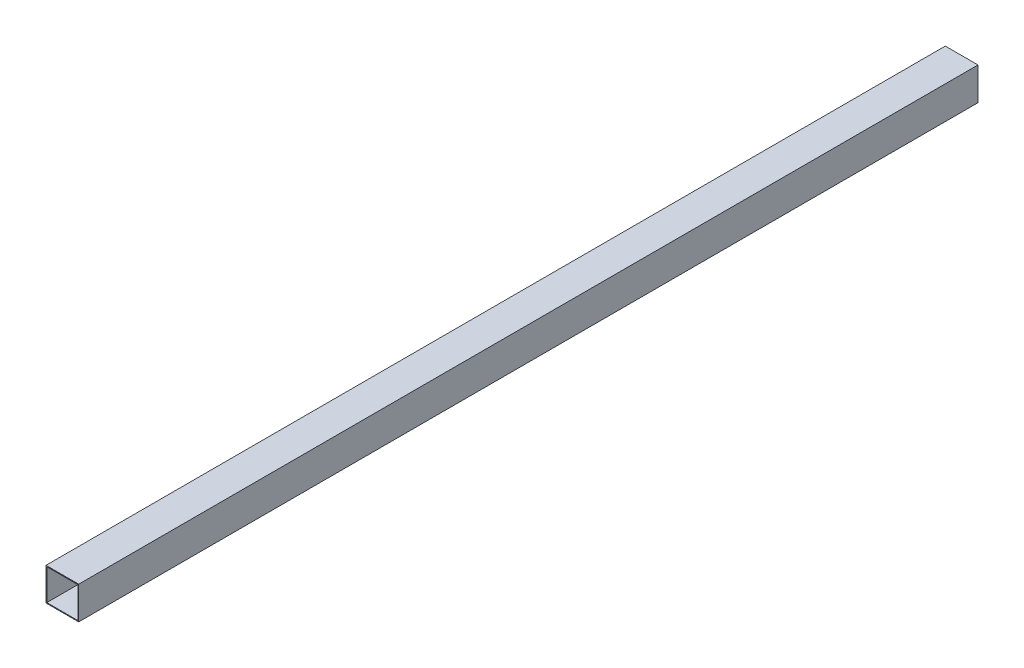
from build123d import *

# Parameters (mm, degrees)
SCHIZZO1_W                = 40
SCHIZZO1_H                = 40
SCHIZZO1_W_2              = 38
SCHIZZO1_H_2              = 38
ESTRUSIONE_SOTTILE1_DEPTH = 1100


with BuildPart() as part:
    # Schizzo1 → Estrusione-Sottile1 (new body)
    with BuildSketch(Plane.XY):
        Rectangle(SCHIZZO1_W, SCHIZZO1_H)
        Rectangle(SCHIZZO1_W_2, SCHIZZO1_H_2, mode=Mode.SUBTRACT)
    extrude(amount=ESTRUSIONE_SOTTILE1_DEPTH)


solid = part.part
